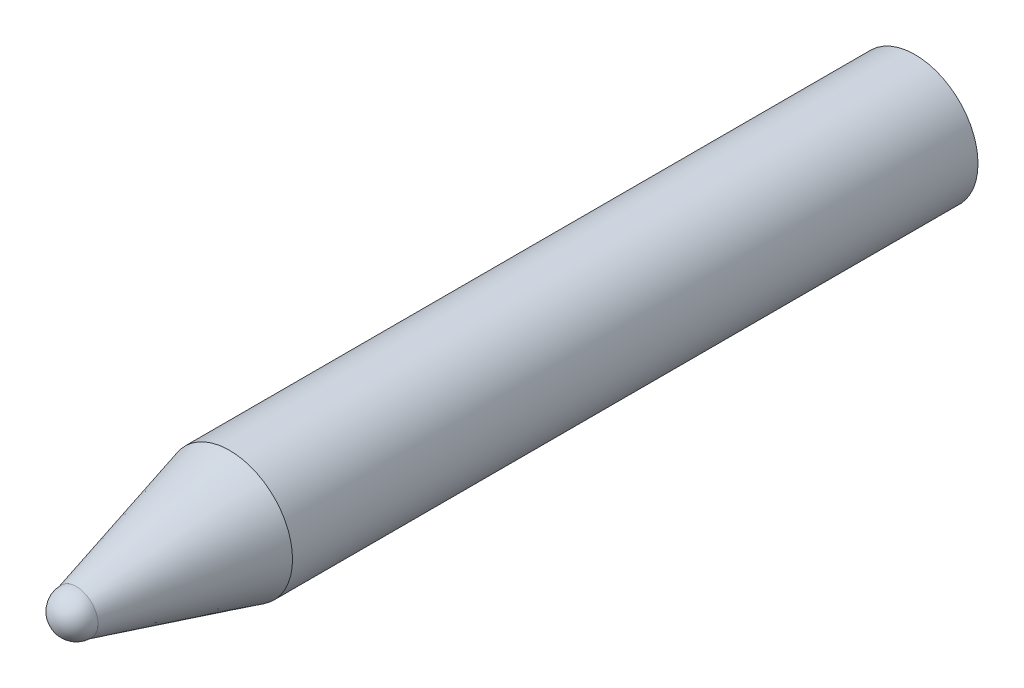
ISO-10303-21;
HEADER;
FILE_DESCRIPTION(('STEP AP214'),'2;1');
FILE_NAME('part.step','',(''),(''),'','','');
FILE_SCHEMA(('AUTOMOTIVE_DESIGN { 1 0 10303 214 1 1 1 1 }'));
ENDSEC;
DATA;
#1=APPLICATION_CONTEXT('core data for automotive mechanical design processes');
#2=APPLICATION_PROTOCOL_DEFINITION('international standard','automotive_design',2000,#1);
#3=PRODUCT_CONTEXT('',#1,'mechanical');
#4=PRODUCT('Part','Part','',(#3));
#5=PRODUCT_RELATED_PRODUCT_CATEGORY('part','',(#4));
#6=PRODUCT_DEFINITION_FORMATION('','',#4);
#7=PRODUCT_DEFINITION_CONTEXT('part definition',#1,'design');
#8=PRODUCT_DEFINITION('design','',#6,#7);
#9=PRODUCT_DEFINITION_SHAPE('','',#8);
#10=(LENGTH_UNIT() NAMED_UNIT(*) SI_UNIT(.MILLI.,.METRE.));
#11=(NAMED_UNIT(*) PLANE_ANGLE_UNIT() SI_UNIT($,.RADIAN.));
#12=(NAMED_UNIT(*) SI_UNIT($,.STERADIAN.) SOLID_ANGLE_UNIT());
#13=UNCERTAINTY_MEASURE_WITH_UNIT(LENGTH_MEASURE(1.E-05),#10,'distance_accuracy_value','');
#14=(GEOMETRIC_REPRESENTATION_CONTEXT(3) GLOBAL_UNCERTAINTY_ASSIGNED_CONTEXT((#13)) GLOBAL_UNIT_ASSIGNED_CONTEXT((#10,
#11,#12)) REPRESENTATION_CONTEXT('',''));
#15=CARTESIAN_POINT('',(0.,0.,0.));
#16=DIRECTION('',(0.,0.,1.));
#17=DIRECTION('',(1.,0.,0.));
#18=AXIS2_PLACEMENT_3D('',#15,#16,#17);
#19=CARTESIAN_POINT('',(0.,0.,116.6));
#20=DIRECTION('',(0.,0.,-1.));
#21=DIRECTION('',(-1.,0.,0.));
#22=AXIS2_PLACEMENT_3D('',#19,#20,#21);
#23=CYLINDRICAL_SURFACE('',#22,8.75);
#24=CARTESIAN_POINT('',(0.,0.,95.3));
#25=DIRECTION('',(0.,0.,1.));
#26=DIRECTION('',(1.,0.,0.));
#27=AXIS2_PLACEMENT_3D('',#24,#25,#26);
#28=CIRCLE('',#27,8.75);
#29=CARTESIAN_POINT('',(8.75,0.,95.3));
#30=VERTEX_POINT('',#29);
#31=EDGE_CURVE('E10',#30,#30,#28,.F.);
#32=ORIENTED_EDGE('',*,*,#31,.T.);
#33=EDGE_LOOP('',(#32));
#34=FACE_BOUND('',#33,.T.);
#35=CARTESIAN_POINT('',(0.,0.,0.));
#36=DIRECTION('',(0.,0.,1.));
#37=DIRECTION('',(1.,0.,0.));
#38=AXIS2_PLACEMENT_3D('',#35,#36,#37);
#39=CIRCLE('',#38,8.75);
#40=CARTESIAN_POINT('',(8.75,0.,0.));
#41=VERTEX_POINT('',#40);
#42=EDGE_CURVE('E40',#41,#41,#39,.T.);
#43=ORIENTED_EDGE('',*,*,#42,.T.);
#44=EDGE_LOOP('',(#43));
#45=FACE_BOUND('',#44,.T.);
#46=ADVANCED_FACE('F29',(#34,#45),#23,.T.);
#47=CARTESIAN_POINT('',(0.,0.,116.6));
#48=DIRECTION('',(0.,0.,1.));
#49=DIRECTION('',(1.,0.,0.));
#50=AXIS2_PLACEMENT_3D('',#47,#48,#49);
#51=SPHERICAL_SURFACE('',#50,3.);
#52=CARTESIAN_POINT('',(0.,0.,116.6));
#53=DIRECTION('',(0.,0.,1.));
#54=DIRECTION('',(1.,0.,0.));
#55=AXIS2_PLACEMENT_3D('',#52,#53,#54);
#56=CIRCLE('',#55,3.);
#57=CARTESIAN_POINT('',(3.,0.,116.6));
#58=VERTEX_POINT('',#57);
#59=EDGE_CURVE('E36',#58,#58,#56,.T.);
#60=ORIENTED_EDGE('',*,*,#59,.T.);
#61=EDGE_LOOP('',(#60));
#62=FACE_BOUND('',#61,.T.);
#63=ADVANCED_FACE('F31',(#62),#51,.T.);
#64=CARTESIAN_POINT('',(0.,0.,0.));
#65=DIRECTION('',(0.,0.,1.));
#66=DIRECTION('',(1.,0.,0.));
#67=AXIS2_PLACEMENT_3D('',#64,#65,#66);
#68=PLANE('',#67);
#69=CARTESIAN_POINT('',(0.,0.,0.));
#70=DIRECTION('',(0.,0.,1.));
#71=DIRECTION('',(1.,0.,0.));
#72=AXIS2_PLACEMENT_3D('',#69,#70,#71);
#73=CIRCLE('',#72,7.42);
#74=CARTESIAN_POINT('',(7.42,0.,0.));
#75=VERTEX_POINT('',#74);
#76=EDGE_CURVE('E47',#75,#75,#73,.T.);
#77=ORIENTED_EDGE('',*,*,#76,.T.);
#78=EDGE_LOOP('',(#77));
#79=FACE_BOUND('',#78,.T.);
#80=ORIENTED_EDGE('',*,*,#42,.F.);
#81=EDGE_LOOP('',(#80));
#82=FACE_BOUND('',#81,.T.);
#83=ADVANCED_FACE('F67',(#79,#82),#68,.F.);
#84=CARTESIAN_POINT('',(0.,0.,116.6));
#85=DIRECTION('',(0.,0.,-1.));
#86=DIRECTION('',(-1.,0.,0.));
#87=AXIS2_PLACEMENT_3D('',#84,#85,#86);
#88=CONICAL_SURFACE('',#87,3.,0.26366807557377);
#89=ORIENTED_EDGE('',*,*,#31,.F.);
#90=EDGE_LOOP('',(#89));
#91=FACE_BOUND('',#90,.T.);
#92=ORIENTED_EDGE('',*,*,#59,.F.);
#93=EDGE_LOOP('',(#92));
#94=FACE_BOUND('',#93,.T.);
#95=ADVANCED_FACE('F63',(#91,#94),#88,.T.);
#96=CARTESIAN_POINT('',(0.,0.,116.6));
#97=DIRECTION('',(0.,0.,-1.));
#98=DIRECTION('',(-1.,0.,0.));
#99=AXIS2_PLACEMENT_3D('',#96,#97,#98);
#100=CYLINDRICAL_SURFACE('',#99,7.42);
#101=CARTESIAN_POINT('',(0.,0.,95.1236378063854));
#102=DIRECTION('',(0.,0.,-1.));
#103=DIRECTION('',(-1.,0.,0.));
#104=AXIS2_PLACEMENT_3D('',#101,#102,#103);
#105=CIRCLE('',#104,7.42);
#106=CARTESIAN_POINT('',(-7.42,0.,95.1236378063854));
#107=VERTEX_POINT('',#106);
#108=EDGE_CURVE('E44',#107,#107,#105,.T.);
#109=ORIENTED_EDGE('',*,*,#108,.F.);
#110=EDGE_LOOP('',(#109));
#111=FACE_BOUND('',#110,.T.);
#112=ORIENTED_EDGE('',*,*,#76,.F.);
#113=EDGE_LOOP('',(#112));
#114=FACE_BOUND('',#113,.T.);
#115=ADVANCED_FACE('F59',(#111,#114),#100,.F.);
#116=CARTESIAN_POINT('',(0.,0.,116.6));
#117=DIRECTION('',(0.,0.,1.));
#118=DIRECTION('',(1.,0.,0.));
#119=AXIS2_PLACEMENT_3D('',#116,#117,#118);
#120=SPHERICAL_SURFACE('',#119,1.67);
#121=CARTESIAN_POINT('',(0.,0.,116.448983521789));
#122=DIRECTION('',(0.,0.,1.));
#123=DIRECTION('',(1.,0.,0.));
#124=AXIS2_PLACEMENT_3D('',#121,#122,#123);
#125=CIRCLE('',#124,1.66315784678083);
#126=CARTESIAN_POINT('',(-1.66315784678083,0.,116.448983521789));
#127=VERTEX_POINT('',#126);
#128=EDGE_CURVE('E50',#127,#127,#125,.T.);
#129=ORIENTED_EDGE('',*,*,#128,.F.);
#130=EDGE_LOOP('',(#129));
#131=FACE_BOUND('',#130,.T.);
#132=ADVANCED_FACE('F62',(#131),#120,.F.);
#133=CARTESIAN_POINT('',(0.,0.,116.253370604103));
#134=DIRECTION('',(0.,0.,-1.));
#135=DIRECTION('',(-1.,0.,0.));
#136=AXIS2_PLACEMENT_3D('',#133,#134,#135);
#137=CONICAL_SURFACE('',#136,1.71596415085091,0.26366807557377);
#138=CARTESIAN_POINT('',(-7.42,0.,95.1236378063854));
#139=CARTESIAN_POINT('',(-7.3600328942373,0.,95.3457768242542));
#140=CARTESIAN_POINT('',(-7.3000657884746,0.,95.567915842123));
#141=CARTESIAN_POINT('',(-7.1801315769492,0.,96.0121938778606));
#142=CARTESIAN_POINT('',(-7.1201644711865,0.,96.2343328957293));
#143=CARTESIAN_POINT('',(-7.0002302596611,0.,96.6786109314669));
#144=CARTESIAN_POINT('',(-6.9402631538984,0.,96.9007499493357));
#145=CARTESIAN_POINT('',(-6.82032894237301,0.,97.3450279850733));
#146=CARTESIAN_POINT('',(-6.76036183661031,0.,97.567167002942));
#147=CARTESIAN_POINT('',(-6.64042762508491,0.,98.0114450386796));
#148=CARTESIAN_POINT('',(-6.58046051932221,0.,98.2335840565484));
#149=CARTESIAN_POINT('',(-6.46052630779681,0.,98.6778620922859));
#150=CARTESIAN_POINT('',(-6.40055920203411,0.,98.9000011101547));
#151=CARTESIAN_POINT('',(-6.28062499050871,0.,99.3442791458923));
#152=CARTESIAN_POINT('',(-6.22065788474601,0.,99.5664181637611));
#153=CARTESIAN_POINT('',(-6.10072367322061,0.,100.010696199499));
#154=CARTESIAN_POINT('',(-6.04075656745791,0.,100.232835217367));
#155=CARTESIAN_POINT('',(-5.92082235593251,0.,100.677113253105));
#156=CARTESIAN_POINT('',(-5.86085525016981,0.,100.899252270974));
#157=CARTESIAN_POINT('',(-5.74092103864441,0.,101.343530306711));
#158=CARTESIAN_POINT('',(-5.68095393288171,0.,101.56566932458));
#159=CARTESIAN_POINT('',(-5.56101972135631,0.,102.009947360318));
#160=CARTESIAN_POINT('',(-5.50105261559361,0.,102.232086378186));
#161=CARTESIAN_POINT('',(-5.38111840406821,0.,102.676364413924));
#162=CARTESIAN_POINT('',(-5.32115129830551,0.,102.898503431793));
#163=CARTESIAN_POINT('',(-5.20121708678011,0.,103.34278146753));
#164=CARTESIAN_POINT('',(-5.14124998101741,0.,103.564920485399));
#165=CARTESIAN_POINT('',(-5.02131576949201,0.,104.009198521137));
#166=CARTESIAN_POINT('',(-4.96134866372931,0.,104.231337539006));
#167=CARTESIAN_POINT('',(-4.84141445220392,0.,104.675615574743));
#168=CARTESIAN_POINT('',(-4.78144734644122,0.,104.897754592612));
#169=CARTESIAN_POINT('',(-4.66151313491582,0.,105.342032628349));
#170=CARTESIAN_POINT('',(-4.60154602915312,0.,105.564171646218));
#171=CARTESIAN_POINT('',(-4.48161181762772,0.,106.008449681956));
#172=CARTESIAN_POINT('',(-4.42164471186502,0.,106.230588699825));
#173=CARTESIAN_POINT('',(-4.30171050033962,0.,106.674866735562));
#174=CARTESIAN_POINT('',(-4.24174339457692,0.,106.897005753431));
#175=CARTESIAN_POINT('',(-4.12180918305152,0.,107.341283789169));
#176=CARTESIAN_POINT('',(-4.06184207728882,0.,107.563422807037));
#177=CARTESIAN_POINT('',(-3.94190786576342,0.,108.007700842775));
#178=CARTESIAN_POINT('',(-3.88194076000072,0.,108.229839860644));
#179=CARTESIAN_POINT('',(-3.76200654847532,0.,108.674117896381));
#180=CARTESIAN_POINT('',(-3.70203944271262,0.,108.89625691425));
#181=CARTESIAN_POINT('',(-3.58210523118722,0.,109.340534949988));
#182=CARTESIAN_POINT('',(-3.52213812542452,0.,109.562673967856));
#183=CARTESIAN_POINT('',(-3.40220391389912,0.,110.006952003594));
#184=CARTESIAN_POINT('',(-3.34223680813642,0.,110.229091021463));
#185=CARTESIAN_POINT('',(-3.22230259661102,0.,110.6733690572));
#186=CARTESIAN_POINT('',(-3.16233549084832,0.,110.895508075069));
#187=CARTESIAN_POINT('',(-3.04240127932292,0.,111.339786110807));
#188=CARTESIAN_POINT('',(-2.98243417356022,0.,111.561925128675));
#189=CARTESIAN_POINT('',(-2.86249996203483,0.,112.006203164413));
#190=CARTESIAN_POINT('',(-2.80253285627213,0.,112.228342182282));
#191=CARTESIAN_POINT('',(-2.68259864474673,0.,112.672620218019));
#192=CARTESIAN_POINT('',(-2.62263153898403,0.,112.894759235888));
#193=CARTESIAN_POINT('',(-2.50269732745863,0.,113.339037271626));
#194=CARTESIAN_POINT('',(-2.44273022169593,0.,113.561176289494));
#195=CARTESIAN_POINT('',(-2.32279601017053,0.,114.005454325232));
#196=CARTESIAN_POINT('',(-2.26282890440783,0.,114.227593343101));
#197=CARTESIAN_POINT('',(-2.14289469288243,0.,114.671871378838));
#198=CARTESIAN_POINT('',(-2.08292758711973,0.,114.894010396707));
#199=CARTESIAN_POINT('',(-1.96299337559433,0.,115.338288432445));
#200=CARTESIAN_POINT('',(-1.90302626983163,0.,115.560427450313));
#201=CARTESIAN_POINT('',(-1.78309205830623,0.,116.004705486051));
#202=CARTESIAN_POINT('',(-1.72312495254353,0.,116.22684450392));
#203=CARTESIAN_POINT('',(-1.66315784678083,0.,116.448983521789));
#204=B_SPLINE_CURVE_WITH_KNOTS('',3,(#138,#139,#140,#141,#142,#143,#144,#145,#146,#147,#148,
#149,#150,#151,#152,#153,#154,#155,#156,#157,#158,#159,#160,#161,#162,#163,#164,#165,#166,#167,
#168,#169,#170,#171,#172,#173,#174,#175,#176,#177,#178,#179,#180,#181,#182,#183,#184,#185,#186,
#187,#188,#189,#190,#191,#192,#193,#194,#195,#196,#197,#198,#199,#200,#201,#202,#203),
.UNSPECIFIED.,.F.,.F.,(4,2,2,2,2,2,2,2,2,2,2,2,2,2,2,2,2,2,2,2,2,2,2,2,2,2,2,2,2,2,2,2,4),(0.,
0.690272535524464,1.38054507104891,2.07081760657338,2.76109014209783,3.45136267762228,
4.14163521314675,4.83190774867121,5.52218028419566,6.21245281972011,6.90272535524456,
7.59299789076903,8.28327042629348,8.97354296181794,9.66381549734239,10.3540880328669,
11.0443605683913,11.7346331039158,12.4249056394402,13.1151781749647,13.8054507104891,
14.4957232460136,15.185995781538,15.8762683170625,16.566540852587,17.2568133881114,
17.9470859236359,18.6373584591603,19.3276309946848,20.0179035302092,20.7081760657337,
21.3984486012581,22.0887211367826),.UNSPECIFIED.);
#205=EDGE_CURVE('BSEAM56',#107,#127,#204,.T.);
#206=ORIENTED_EDGE('',*,*,#108,.T.);
#207=ORIENTED_EDGE('',*,*,#128,.T.);
#208=ORIENTED_EDGE('',*,*,#205,.T.);
#209=ORIENTED_EDGE('',*,*,#205,.F.);
#210=EDGE_LOOP('',(#206,#208,#207,#209));
#211=FACE_BOUND('',#210,.T.);
#212=ADVANCED_FACE('F56',(#211),#137,.F.);
#213=CLOSED_SHELL('',(#46,#63,#83,#95,#115,#132,#212));
#214=MANIFOLD_SOLID_BREP('B2',#213);
#215=ADVANCED_BREP_SHAPE_REPRESENTATION('',(#18,#214),#14);
#216=SHAPE_DEFINITION_REPRESENTATION(#9,#215);
ENDSEC;
END-ISO-10303-21;
